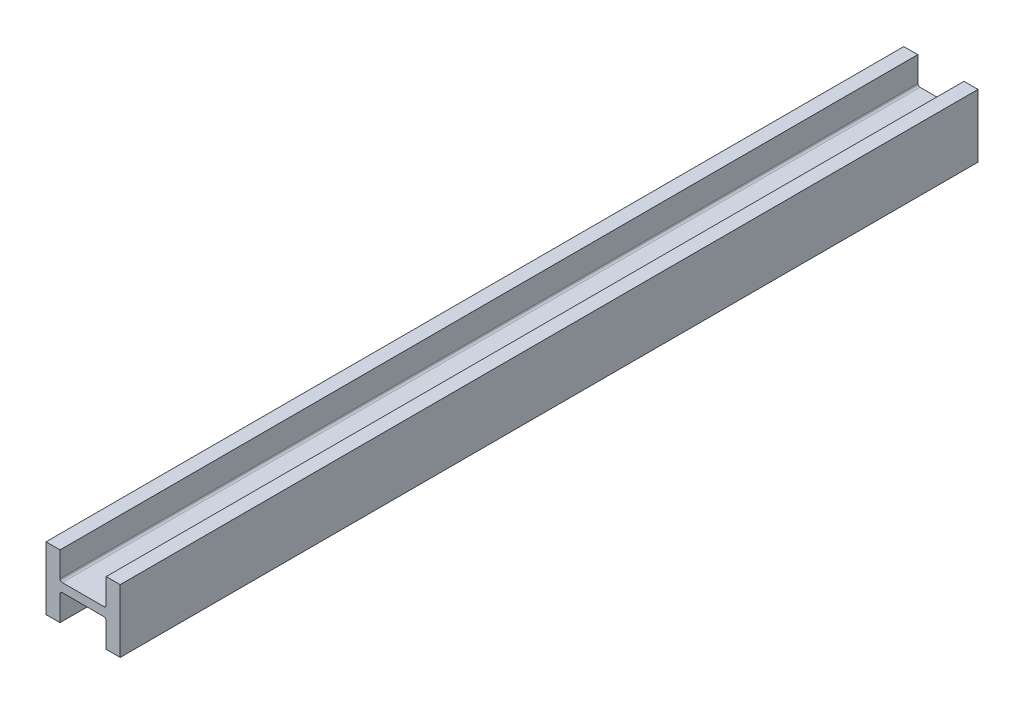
ISO-10303-21;
HEADER;
FILE_DESCRIPTION(('STEP AP214'),'2;1');
FILE_NAME('part.step','',(''),(''),'','','');
FILE_SCHEMA(('AUTOMOTIVE_DESIGN { 1 0 10303 214 1 1 1 1 }'));
ENDSEC;
DATA;
#1=APPLICATION_CONTEXT('core data for automotive mechanical design processes');
#2=APPLICATION_PROTOCOL_DEFINITION('international standard','automotive_design',2000,#1);
#3=PRODUCT_CONTEXT('',#1,'mechanical');
#4=PRODUCT('Part','Part','',(#3));
#5=PRODUCT_RELATED_PRODUCT_CATEGORY('part','',(#4));
#6=PRODUCT_DEFINITION_FORMATION('','',#4);
#7=PRODUCT_DEFINITION_CONTEXT('part definition',#1,'design');
#8=PRODUCT_DEFINITION('design','',#6,#7);
#9=PRODUCT_DEFINITION_SHAPE('','',#8);
#10=(LENGTH_UNIT() NAMED_UNIT(*) SI_UNIT(.MILLI.,.METRE.));
#11=(NAMED_UNIT(*) PLANE_ANGLE_UNIT() SI_UNIT($,.RADIAN.));
#12=(NAMED_UNIT(*) SI_UNIT($,.STERADIAN.) SOLID_ANGLE_UNIT());
#13=UNCERTAINTY_MEASURE_WITH_UNIT(LENGTH_MEASURE(1.E-05),#10,'distance_accuracy_value','');
#14=(GEOMETRIC_REPRESENTATION_CONTEXT(3) GLOBAL_UNCERTAINTY_ASSIGNED_CONTEXT((#13)) GLOBAL_UNIT_ASSIGNED_CONTEXT((#10,
#11,#12)) REPRESENTATION_CONTEXT('',''));
#15=CARTESIAN_POINT('',(0.,0.,0.));
#16=DIRECTION('',(0.,0.,1.));
#17=DIRECTION('',(1.,0.,0.));
#18=AXIS2_PLACEMENT_3D('',#15,#16,#17);
#19=CARTESIAN_POINT('',(257.048,218.440000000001,2971.8));
#20=DIRECTION('',(-1.,0.,0.));
#21=DIRECTION('',(0.,0.,1.));
#22=AXIS2_PLACEMENT_3D('',#19,#20,#21);
#23=PLANE('',#22);
#24=DIRECTION('',(0.,1.,0.));
#25=VECTOR('',#24,1.);
#26=CARTESIAN_POINT('',(257.048,218.440000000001,-2971.8));
#27=LINE('',#26,#25);
#28=CARTESIAN_POINT('',(257.048,-218.439999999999,-2971.8));
#29=VERTEX_POINT('',#28);
#30=CARTESIAN_POINT('',(257.048,218.440000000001,-2971.8));
#31=VERTEX_POINT('',#30);
#32=EDGE_CURVE('E193',#29,#31,#27,.T.);
#33=ORIENTED_EDGE('',*,*,#32,.T.);
#34=DIRECTION('',(0.,0.,-1.));
#35=VECTOR('',#34,1.);
#36=CARTESIAN_POINT('',(257.048,218.440000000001,2971.8));
#37=LINE('',#36,#35);
#38=CARTESIAN_POINT('',(257.048,218.440000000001,2971.8));
#39=VERTEX_POINT('',#38);
#40=EDGE_CURVE('E11',#39,#31,#37,.T.);
#41=ORIENTED_EDGE('',*,*,#40,.F.);
#42=DIRECTION('',(0.,1.,0.));
#43=VECTOR('',#42,1.);
#44=CARTESIAN_POINT('',(257.048,218.440000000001,2971.8));
#45=LINE('',#44,#43);
#46=CARTESIAN_POINT('',(257.048,-218.439999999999,2971.8));
#47=VERTEX_POINT('',#46);
#48=EDGE_CURVE('E238',#47,#39,#45,.T.);
#49=ORIENTED_EDGE('',*,*,#48,.F.);
#50=DIRECTION('',(0.,0.,-1.));
#51=VECTOR('',#50,1.);
#52=CARTESIAN_POINT('',(257.048,-218.439999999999,2971.8));
#53=LINE('',#52,#51);
#54=EDGE_CURVE('E186',#47,#29,#53,.T.);
#55=ORIENTED_EDGE('',*,*,#54,.T.);
#56=EDGE_LOOP('',(#33,#41,#49,#55));
#57=FACE_BOUND('',#56,.T.);
#58=ADVANCED_FACE('F44',(#57),#23,.F.);
#59=CARTESIAN_POINT('',(160.02,218.440000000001,2971.8));
#60=DIRECTION('',(0.,-1.,0.));
#61=DIRECTION('',(0.,0.,-1.));
#62=AXIS2_PLACEMENT_3D('',#59,#60,#61);
#63=PLANE('',#62);
#64=DIRECTION('',(-1.,0.,0.));
#65=VECTOR('',#64,1.);
#66=CARTESIAN_POINT('',(160.02,218.440000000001,-2971.8));
#67=LINE('',#66,#65);
#68=CARTESIAN_POINT('',(160.02,218.440000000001,-2971.8));
#69=VERTEX_POINT('',#68);
#70=EDGE_CURVE('E196',#31,#69,#67,.T.);
#71=ORIENTED_EDGE('',*,*,#70,.T.);
#72=DIRECTION('',(0.,0.,-1.));
#73=VECTOR('',#72,1.);
#74=CARTESIAN_POINT('',(160.02,218.440000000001,2971.8));
#75=LINE('',#74,#73);
#76=CARTESIAN_POINT('',(160.02,218.440000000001,2971.8));
#77=VERTEX_POINT('',#76);
#78=EDGE_CURVE('E53',#77,#69,#75,.T.);
#79=ORIENTED_EDGE('',*,*,#78,.F.);
#80=DIRECTION('',(-1.,0.,0.));
#81=VECTOR('',#80,1.);
#82=CARTESIAN_POINT('',(160.02,218.440000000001,2971.8));
#83=LINE('',#82,#81);
#84=EDGE_CURVE('E129',#39,#77,#83,.T.);
#85=ORIENTED_EDGE('',*,*,#84,.F.);
#86=ORIENTED_EDGE('',*,*,#40,.T.);
#87=EDGE_LOOP('',(#71,#79,#85,#86));
#88=FACE_BOUND('',#87,.T.);
#89=ADVANCED_FACE('F362',(#88),#63,.F.);
#90=CARTESIAN_POINT('',(160.02,45.4660000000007,2971.8));
#91=DIRECTION('',(1.,0.,0.));
#92=DIRECTION('',(0.,0.,-1.));
#93=AXIS2_PLACEMENT_3D('',#90,#91,#92);
#94=PLANE('',#93);
#95=DIRECTION('',(0.,-1.,0.));
#96=VECTOR('',#95,1.);
#97=CARTESIAN_POINT('',(160.02,45.4660000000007,-2971.8));
#98=LINE('',#97,#96);
#99=CARTESIAN_POINT('',(160.02,45.4660000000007,-2971.8));
#100=VERTEX_POINT('',#99);
#101=EDGE_CURVE('E203',#69,#100,#98,.T.);
#102=ORIENTED_EDGE('',*,*,#101,.T.);
#103=DIRECTION('',(0.,0.,-1.));
#104=VECTOR('',#103,1.);
#105=CARTESIAN_POINT('',(160.02,45.4660000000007,2971.8));
#106=LINE('',#105,#104);
#107=CARTESIAN_POINT('',(160.02,45.4660000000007,2971.8));
#108=VERTEX_POINT('',#107);
#109=EDGE_CURVE('E282',#108,#100,#106,.T.);
#110=ORIENTED_EDGE('',*,*,#109,.F.);
#111=DIRECTION('',(0.,-1.,0.));
#112=VECTOR('',#111,1.);
#113=CARTESIAN_POINT('',(160.02,45.4660000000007,2971.8));
#114=LINE('',#113,#112);
#115=EDGE_CURVE('E291',#77,#108,#114,.T.);
#116=ORIENTED_EDGE('',*,*,#115,.F.);
#117=ORIENTED_EDGE('',*,*,#78,.T.);
#118=EDGE_LOOP('',(#102,#110,#116,#117));
#119=FACE_BOUND('',#118,.T.);
#120=ADVANCED_FACE('F292',(#119),#94,.F.);
#121=CARTESIAN_POINT('',(144.78,45.4660000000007,2971.8));
#122=DIRECTION('',(0.,0.,-1.));
#123=DIRECTION('',(-1.,0.,0.));
#124=AXIS2_PLACEMENT_3D('',#121,#122,#123);
#125=CYLINDRICAL_SURFACE('',#124,15.24);
#126=CARTESIAN_POINT('',(144.78,45.4660000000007,-2971.8));
#127=DIRECTION('',(0.,0.,-1.));
#128=DIRECTION('',(1.,0.,0.));
#129=AXIS2_PLACEMENT_3D('',#126,#127,#128);
#130=CIRCLE('',#129,15.24);
#131=CARTESIAN_POINT('',(144.78,30.2260000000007,-2971.8));
#132=VERTEX_POINT('',#131);
#133=EDGE_CURVE('E204',#100,#132,#130,.T.);
#134=ORIENTED_EDGE('',*,*,#133,.T.);
#135=DIRECTION('',(0.,0.,-1.));
#136=VECTOR('',#135,1.);
#137=CARTESIAN_POINT('',(144.78,30.2260000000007,2971.8));
#138=LINE('',#137,#136);
#139=CARTESIAN_POINT('',(144.78,30.2260000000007,2971.8));
#140=VERTEX_POINT('',#139);
#141=EDGE_CURVE('E276',#140,#132,#138,.T.);
#142=ORIENTED_EDGE('',*,*,#141,.F.);
#143=CARTESIAN_POINT('',(144.78,45.4660000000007,2971.8));
#144=DIRECTION('',(0.,0.,-1.));
#145=DIRECTION('',(1.,0.,0.));
#146=AXIS2_PLACEMENT_3D('',#143,#144,#145);
#147=CIRCLE('',#146,15.24);
#148=EDGE_CURVE('E315',#108,#140,#147,.T.);
#149=ORIENTED_EDGE('',*,*,#148,.F.);
#150=ORIENTED_EDGE('',*,*,#109,.T.);
#151=EDGE_LOOP('',(#134,#142,#149,#150));
#152=FACE_BOUND('',#151,.T.);
#153=ADVANCED_FACE('F301',(#152),#125,.F.);
#154=CARTESIAN_POINT('',(-144.78,30.2260000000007,2971.8));
#155=DIRECTION('',(0.,-1.,0.));
#156=DIRECTION('',(1.,0.,0.));
#157=AXIS2_PLACEMENT_3D('',#154,#155,#156);
#158=PLANE('',#157);
#159=DIRECTION('',(-1.,0.,0.));
#160=VECTOR('',#159,1.);
#161=CARTESIAN_POINT('',(-144.78,30.2260000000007,-2971.8));
#162=LINE('',#161,#160);
#163=CARTESIAN_POINT('',(-144.78,30.2260000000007,-2971.8));
#164=VERTEX_POINT('',#163);
#165=EDGE_CURVE('E210',#132,#164,#162,.T.);
#166=ORIENTED_EDGE('',*,*,#165,.T.);
#167=DIRECTION('',(0.,0.,-1.));
#168=VECTOR('',#167,1.);
#169=CARTESIAN_POINT('',(-144.78,30.2260000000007,2971.8));
#170=LINE('',#169,#168);
#171=CARTESIAN_POINT('',(-144.78,30.2260000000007,2971.8));
#172=VERTEX_POINT('',#171);
#173=EDGE_CURVE('E274',#172,#164,#170,.T.);
#174=ORIENTED_EDGE('',*,*,#173,.F.);
#175=DIRECTION('',(-1.,0.,0.));
#176=VECTOR('',#175,1.);
#177=CARTESIAN_POINT('',(-144.78,30.2260000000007,2971.8));
#178=LINE('',#177,#176);
#179=EDGE_CURVE('E306',#140,#172,#178,.T.);
#180=ORIENTED_EDGE('',*,*,#179,.F.);
#181=ORIENTED_EDGE('',*,*,#141,.T.);
#182=EDGE_LOOP('',(#166,#174,#180,#181));
#183=FACE_BOUND('',#182,.T.);
#184=ADVANCED_FACE('F308',(#183),#158,.F.);
#185=CARTESIAN_POINT('',(-144.78,45.4660000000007,2971.8));
#186=DIRECTION('',(0.,0.,-1.));
#187=DIRECTION('',(-1.,0.,0.));
#188=AXIS2_PLACEMENT_3D('',#185,#186,#187);
#189=CYLINDRICAL_SURFACE('',#188,15.24);
#190=CARTESIAN_POINT('',(-144.78,45.4660000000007,-2971.8));
#191=DIRECTION('',(0.,0.,-1.));
#192=DIRECTION('',(1.,0.,0.));
#193=AXIS2_PLACEMENT_3D('',#190,#191,#192);
#194=CIRCLE('',#193,15.24);
#195=CARTESIAN_POINT('',(-160.02,45.4660000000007,-2971.8));
#196=VERTEX_POINT('',#195);
#197=EDGE_CURVE('E209',#164,#196,#194,.T.);
#198=ORIENTED_EDGE('',*,*,#197,.T.);
#199=DIRECTION('',(0.,0.,-1.));
#200=VECTOR('',#199,1.);
#201=CARTESIAN_POINT('',(-160.02,45.4660000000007,2971.8));
#202=LINE('',#201,#200);
#203=CARTESIAN_POINT('',(-160.02,45.4660000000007,2971.8));
#204=VERTEX_POINT('',#203);
#205=EDGE_CURVE('E271',#204,#196,#202,.T.);
#206=ORIENTED_EDGE('',*,*,#205,.F.);
#207=CARTESIAN_POINT('',(-144.78,45.4660000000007,2971.8));
#208=DIRECTION('',(0.,0.,-1.));
#209=DIRECTION('',(1.,0.,0.));
#210=AXIS2_PLACEMENT_3D('',#207,#208,#209);
#211=CIRCLE('',#210,15.24);
#212=EDGE_CURVE('E313',#172,#204,#211,.T.);
#213=ORIENTED_EDGE('',*,*,#212,.F.);
#214=ORIENTED_EDGE('',*,*,#173,.T.);
#215=EDGE_LOOP('',(#198,#206,#213,#214));
#216=FACE_BOUND('',#215,.T.);
#217=ADVANCED_FACE('F374',(#216),#189,.F.);
#218=CARTESIAN_POINT('',(-160.02,218.440000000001,2971.8));
#219=DIRECTION('',(-1.,0.,0.));
#220=DIRECTION('',(0.,0.,1.));
#221=AXIS2_PLACEMENT_3D('',#218,#219,#220);
#222=PLANE('',#221);
#223=DIRECTION('',(0.,1.,0.));
#224=VECTOR('',#223,1.);
#225=CARTESIAN_POINT('',(-160.02,218.440000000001,-2971.8));
#226=LINE('',#225,#224);
#227=CARTESIAN_POINT('',(-160.02,218.440000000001,-2971.8));
#228=VERTEX_POINT('',#227);
#229=EDGE_CURVE('E213',#196,#228,#226,.T.);
#230=ORIENTED_EDGE('',*,*,#229,.T.);
#231=DIRECTION('',(0.,0.,-1.));
#232=VECTOR('',#231,1.);
#233=CARTESIAN_POINT('',(-160.02,218.440000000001,2971.8));
#234=LINE('',#233,#232);
#235=CARTESIAN_POINT('',(-160.02,218.440000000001,2971.8));
#236=VERTEX_POINT('',#235);
#237=EDGE_CURVE('E270',#236,#228,#234,.T.);
#238=ORIENTED_EDGE('',*,*,#237,.F.);
#239=DIRECTION('',(0.,1.,0.));
#240=VECTOR('',#239,1.);
#241=CARTESIAN_POINT('',(-160.02,218.440000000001,2971.8));
#242=LINE('',#241,#240);
#243=EDGE_CURVE('E316',#204,#236,#242,.T.);
#244=ORIENTED_EDGE('',*,*,#243,.F.);
#245=ORIENTED_EDGE('',*,*,#205,.T.);
#246=EDGE_LOOP('',(#230,#238,#244,#245));
#247=FACE_BOUND('',#246,.T.);
#248=ADVANCED_FACE('F378',(#247),#222,.F.);
#249=CARTESIAN_POINT('',(-257.048,218.440000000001,2971.8));
#250=DIRECTION('',(0.,-1.,0.));
#251=DIRECTION('',(1.,0.,0.));
#252=AXIS2_PLACEMENT_3D('',#249,#250,#251);
#253=PLANE('',#252);
#254=DIRECTION('',(-1.,0.,0.));
#255=VECTOR('',#254,1.);
#256=CARTESIAN_POINT('',(-257.048,218.440000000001,-2971.8));
#257=LINE('',#256,#255);
#258=CARTESIAN_POINT('',(-257.048,218.440000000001,-2971.8));
#259=VERTEX_POINT('',#258);
#260=EDGE_CURVE('E216',#228,#259,#257,.T.);
#261=ORIENTED_EDGE('',*,*,#260,.T.);
#262=DIRECTION('',(0.,0.,-1.));
#263=VECTOR('',#262,1.);
#264=CARTESIAN_POINT('',(-257.048,218.440000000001,2971.8));
#265=LINE('',#264,#263);
#266=CARTESIAN_POINT('',(-257.048,218.440000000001,2971.8));
#267=VERTEX_POINT('',#266);
#268=EDGE_CURVE('E263',#267,#259,#265,.T.);
#269=ORIENTED_EDGE('',*,*,#268,.F.);
#270=DIRECTION('',(-1.,0.,0.));
#271=VECTOR('',#270,1.);
#272=CARTESIAN_POINT('',(-257.048,218.440000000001,2971.8));
#273=LINE('',#272,#271);
#274=EDGE_CURVE('E323',#236,#267,#273,.T.);
#275=ORIENTED_EDGE('',*,*,#274,.F.);
#276=ORIENTED_EDGE('',*,*,#237,.T.);
#277=EDGE_LOOP('',(#261,#269,#275,#276));
#278=FACE_BOUND('',#277,.T.);
#279=ADVANCED_FACE('F385',(#278),#253,.F.);
#280=CARTESIAN_POINT('',(-257.048,-218.439999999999,2971.8));
#281=DIRECTION('',(1.,0.,0.));
#282=DIRECTION('',(0.,1.,0.));
#283=AXIS2_PLACEMENT_3D('',#280,#281,#282);
#284=PLANE('',#283);
#285=DIRECTION('',(0.,-1.,0.));
#286=VECTOR('',#285,1.);
#287=CARTESIAN_POINT('',(-257.048,-218.439999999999,-2971.8));
#288=LINE('',#287,#286);
#289=CARTESIAN_POINT('',(-257.048,-218.439999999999,-2971.8));
#290=VERTEX_POINT('',#289);
#291=EDGE_CURVE('E218',#259,#290,#288,.T.);
#292=ORIENTED_EDGE('',*,*,#291,.T.);
#293=DIRECTION('',(0.,0.,-1.));
#294=VECTOR('',#293,1.);
#295=CARTESIAN_POINT('',(-257.048,-218.439999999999,2971.8));
#296=LINE('',#295,#294);
#297=CARTESIAN_POINT('',(-257.048,-218.439999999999,2971.8));
#298=VERTEX_POINT('',#297);
#299=EDGE_CURVE('E259',#298,#290,#296,.T.);
#300=ORIENTED_EDGE('',*,*,#299,.F.);
#301=DIRECTION('',(0.,-1.,0.));
#302=VECTOR('',#301,1.);
#303=CARTESIAN_POINT('',(-257.048,-218.439999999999,2971.8));
#304=LINE('',#303,#302);
#305=EDGE_CURVE('E326',#267,#298,#304,.T.);
#306=ORIENTED_EDGE('',*,*,#305,.F.);
#307=ORIENTED_EDGE('',*,*,#268,.T.);
#308=EDGE_LOOP('',(#292,#300,#306,#307));
#309=FACE_BOUND('',#308,.T.);
#310=ADVANCED_FACE('F387',(#309),#284,.F.);
#311=CARTESIAN_POINT('',(-160.02,-218.439999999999,2971.8));
#312=DIRECTION('',(0.,1.,0.));
#313=DIRECTION('',(0.,0.,1.));
#314=AXIS2_PLACEMENT_3D('',#311,#312,#313);
#315=PLANE('',#314);
#316=DIRECTION('',(1.,0.,0.));
#317=VECTOR('',#316,1.);
#318=CARTESIAN_POINT('',(-160.02,-218.439999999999,-2971.8));
#319=LINE('',#318,#317);
#320=CARTESIAN_POINT('',(-160.02,-218.439999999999,-2971.8));
#321=VERTEX_POINT('',#320);
#322=EDGE_CURVE('E225',#290,#321,#319,.T.);
#323=ORIENTED_EDGE('',*,*,#322,.T.);
#324=DIRECTION('',(0.,0.,-1.));
#325=VECTOR('',#324,1.);
#326=CARTESIAN_POINT('',(-160.02,-218.439999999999,2971.8));
#327=LINE('',#326,#325);
#328=CARTESIAN_POINT('',(-160.02,-218.439999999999,2971.8));
#329=VERTEX_POINT('',#328);
#330=EDGE_CURVE('E254',#329,#321,#327,.T.);
#331=ORIENTED_EDGE('',*,*,#330,.F.);
#332=DIRECTION('',(1.,0.,0.));
#333=VECTOR('',#332,1.);
#334=CARTESIAN_POINT('',(-160.02,-218.439999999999,2971.8));
#335=LINE('',#334,#333);
#336=EDGE_CURVE('E328',#298,#329,#335,.T.);
#337=ORIENTED_EDGE('',*,*,#336,.F.);
#338=ORIENTED_EDGE('',*,*,#299,.T.);
#339=EDGE_LOOP('',(#323,#331,#337,#338));
#340=FACE_BOUND('',#339,.T.);
#341=ADVANCED_FACE('F388',(#340),#315,.F.);
#342=CARTESIAN_POINT('',(-160.02,-45.4659999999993,2971.8));
#343=DIRECTION('',(-1.,0.,0.));
#344=DIRECTION('',(0.,-1.,0.));
#345=AXIS2_PLACEMENT_3D('',#342,#343,#344);
#346=PLANE('',#345);
#347=DIRECTION('',(0.,1.,0.));
#348=VECTOR('',#347,1.);
#349=CARTESIAN_POINT('',(-160.02,-45.4659999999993,-2971.8));
#350=LINE('',#349,#348);
#351=CARTESIAN_POINT('',(-160.02,-45.4659999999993,-2971.8));
#352=VERTEX_POINT('',#351);
#353=EDGE_CURVE('E223',#321,#352,#350,.T.);
#354=ORIENTED_EDGE('',*,*,#353,.T.);
#355=DIRECTION('',(0.,0.,-1.));
#356=VECTOR('',#355,1.);
#357=CARTESIAN_POINT('',(-160.02,-45.4659999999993,2971.8));
#358=LINE('',#357,#356);
#359=CARTESIAN_POINT('',(-160.02,-45.4659999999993,2971.8));
#360=VERTEX_POINT('',#359);
#361=EDGE_CURVE('E253',#360,#352,#358,.T.);
#362=ORIENTED_EDGE('',*,*,#361,.F.);
#363=DIRECTION('',(0.,1.,0.));
#364=VECTOR('',#363,1.);
#365=CARTESIAN_POINT('',(-160.02,-45.4659999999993,2971.8));
#366=LINE('',#365,#364);
#367=EDGE_CURVE('E335',#329,#360,#366,.T.);
#368=ORIENTED_EDGE('',*,*,#367,.F.);
#369=ORIENTED_EDGE('',*,*,#330,.T.);
#370=EDGE_LOOP('',(#354,#362,#368,#369));
#371=FACE_BOUND('',#370,.T.);
#372=ADVANCED_FACE('F395',(#371),#346,.F.);
#373=CARTESIAN_POINT('',(-144.78,-45.4659999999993,2971.8));
#374=DIRECTION('',(0.,0.,-1.));
#375=DIRECTION('',(-1.,0.,0.));
#376=AXIS2_PLACEMENT_3D('',#373,#374,#375);
#377=CYLINDRICAL_SURFACE('',#376,15.24);
#378=CARTESIAN_POINT('',(-144.78,-45.4659999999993,-2971.8));
#379=DIRECTION('',(0.,0.,-1.));
#380=DIRECTION('',(1.,0.,0.));
#381=AXIS2_PLACEMENT_3D('',#378,#379,#380);
#382=CIRCLE('',#381,15.24);
#383=CARTESIAN_POINT('',(-144.78,-30.2259999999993,-2971.8));
#384=VERTEX_POINT('',#383);
#385=EDGE_CURVE('E227',#352,#384,#382,.T.);
#386=ORIENTED_EDGE('',*,*,#385,.T.);
#387=DIRECTION('',(0.,0.,-1.));
#388=VECTOR('',#387,1.);
#389=CARTESIAN_POINT('',(-144.78,-30.2259999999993,2971.8));
#390=LINE('',#389,#388);
#391=CARTESIAN_POINT('',(-144.78,-30.2259999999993,2971.8));
#392=VERTEX_POINT('',#391);
#393=EDGE_CURVE('E246',#392,#384,#390,.T.);
#394=ORIENTED_EDGE('',*,*,#393,.F.);
#395=CARTESIAN_POINT('',(-144.78,-45.4659999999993,2971.8));
#396=DIRECTION('',(0.,0.,-1.));
#397=DIRECTION('',(1.,0.,0.));
#398=AXIS2_PLACEMENT_3D('',#395,#396,#397);
#399=CIRCLE('',#398,15.24);
#400=EDGE_CURVE('E333',#360,#392,#399,.T.);
#401=ORIENTED_EDGE('',*,*,#400,.F.);
#402=ORIENTED_EDGE('',*,*,#361,.T.);
#403=EDGE_LOOP('',(#386,#394,#401,#402));
#404=FACE_BOUND('',#403,.T.);
#405=ADVANCED_FACE('F345',(#404),#377,.F.);
#406=CARTESIAN_POINT('',(144.78,-30.2259999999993,2971.8));
#407=DIRECTION('',(0.,1.,0.));
#408=DIRECTION('',(-1.,0.,0.));
#409=AXIS2_PLACEMENT_3D('',#406,#407,#408);
#410=PLANE('',#409);
#411=DIRECTION('',(1.,0.,0.));
#412=VECTOR('',#411,1.);
#413=CARTESIAN_POINT('',(144.78,-30.2259999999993,-2971.8));
#414=LINE('',#413,#412);
#415=CARTESIAN_POINT('',(144.78,-30.2259999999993,-2971.8));
#416=VERTEX_POINT('',#415);
#417=EDGE_CURVE('E234',#384,#416,#414,.T.);
#418=ORIENTED_EDGE('',*,*,#417,.T.);
#419=DIRECTION('',(0.,0.,-1.));
#420=VECTOR('',#419,1.);
#421=CARTESIAN_POINT('',(144.78,-30.2259999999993,2971.8));
#422=LINE('',#421,#420);
#423=CARTESIAN_POINT('',(144.78,-30.2259999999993,2971.8));
#424=VERTEX_POINT('',#423);
#425=EDGE_CURVE('E181',#424,#416,#422,.T.);
#426=ORIENTED_EDGE('',*,*,#425,.F.);
#427=DIRECTION('',(1.,0.,0.));
#428=VECTOR('',#427,1.);
#429=CARTESIAN_POINT('',(144.78,-30.2259999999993,2971.8));
#430=LINE('',#429,#428);
#431=EDGE_CURVE('E174',#392,#424,#430,.T.);
#432=ORIENTED_EDGE('',*,*,#431,.F.);
#433=ORIENTED_EDGE('',*,*,#393,.T.);
#434=EDGE_LOOP('',(#418,#426,#432,#433));
#435=FACE_BOUND('',#434,.T.);
#436=ADVANCED_FACE('F350',(#435),#410,.F.);
#437=CARTESIAN_POINT('',(144.78,-45.4659999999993,2971.8));
#438=DIRECTION('',(0.,0.,-1.));
#439=DIRECTION('',(-1.,0.,0.));
#440=AXIS2_PLACEMENT_3D('',#437,#438,#439);
#441=CYLINDRICAL_SURFACE('',#440,15.24);
#442=CARTESIAN_POINT('',(144.78,-45.4659999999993,-2971.8));
#443=DIRECTION('',(0.,0.,-1.));
#444=DIRECTION('',(1.,0.,0.));
#445=AXIS2_PLACEMENT_3D('',#442,#443,#444);
#446=CIRCLE('',#445,15.24);
#447=CARTESIAN_POINT('',(160.02,-45.4659999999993,-2971.8));
#448=VERTEX_POINT('',#447);
#449=EDGE_CURVE('E182',#416,#448,#446,.T.);
#450=ORIENTED_EDGE('',*,*,#449,.T.);
#451=DIRECTION('',(0.,0.,-1.));
#452=VECTOR('',#451,1.);
#453=CARTESIAN_POINT('',(160.02,-45.4659999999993,2971.8));
#454=LINE('',#453,#452);
#455=CARTESIAN_POINT('',(160.02,-45.4659999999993,2971.8));
#456=VERTEX_POINT('',#455);
#457=EDGE_CURVE('E180',#456,#448,#454,.T.);
#458=ORIENTED_EDGE('',*,*,#457,.F.);
#459=CARTESIAN_POINT('',(144.78,-45.4659999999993,2971.8));
#460=DIRECTION('',(0.,0.,-1.));
#461=DIRECTION('',(1.,0.,0.));
#462=AXIS2_PLACEMENT_3D('',#459,#460,#461);
#463=CIRCLE('',#462,15.24);
#464=EDGE_CURVE('E167',#424,#456,#463,.T.);
#465=ORIENTED_EDGE('',*,*,#464,.F.);
#466=ORIENTED_EDGE('',*,*,#425,.T.);
#467=EDGE_LOOP('',(#450,#458,#465,#466));
#468=FACE_BOUND('',#467,.T.);
#469=ADVANCED_FACE('F178',(#468),#441,.F.);
#470=CARTESIAN_POINT('',(160.02,-218.439999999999,2971.8));
#471=DIRECTION('',(1.,0.,0.));
#472=DIRECTION('',(0.,0.,-1.));
#473=AXIS2_PLACEMENT_3D('',#470,#471,#472);
#474=PLANE('',#473);
#475=DIRECTION('',(0.,-1.,0.));
#476=VECTOR('',#475,1.);
#477=CARTESIAN_POINT('',(160.02,-218.439999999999,-2971.8));
#478=LINE('',#477,#476);
#479=CARTESIAN_POINT('',(160.02,-218.439999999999,-2971.8));
#480=VERTEX_POINT('',#479);
#481=EDGE_CURVE('E113',#448,#480,#478,.T.);
#482=ORIENTED_EDGE('',*,*,#481,.T.);
#483=DIRECTION('',(0.,0.,-1.));
#484=VECTOR('',#483,1.);
#485=CARTESIAN_POINT('',(160.02,-218.439999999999,2971.8));
#486=LINE('',#485,#484);
#487=CARTESIAN_POINT('',(160.02,-218.439999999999,2971.8));
#488=VERTEX_POINT('',#487);
#489=EDGE_CURVE('E184',#488,#480,#486,.T.);
#490=ORIENTED_EDGE('',*,*,#489,.F.);
#491=DIRECTION('',(0.,-1.,0.));
#492=VECTOR('',#491,1.);
#493=CARTESIAN_POINT('',(160.02,-218.439999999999,2971.8));
#494=LINE('',#493,#492);
#495=EDGE_CURVE('E168',#456,#488,#494,.T.);
#496=ORIENTED_EDGE('',*,*,#495,.F.);
#497=ORIENTED_EDGE('',*,*,#457,.T.);
#498=EDGE_LOOP('',(#482,#490,#496,#497));
#499=FACE_BOUND('',#498,.T.);
#500=ADVANCED_FACE('F188',(#499),#474,.F.);
#501=CARTESIAN_POINT('',(257.048,-218.439999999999,2971.8));
#502=DIRECTION('',(0.,1.,0.));
#503=DIRECTION('',(0.,0.,1.));
#504=AXIS2_PLACEMENT_3D('',#501,#502,#503);
#505=PLANE('',#504);
#506=DIRECTION('',(1.,0.,0.));
#507=VECTOR('',#506,1.);
#508=CARTESIAN_POINT('',(257.048,-218.439999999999,-2971.8));
#509=LINE('',#508,#507);
#510=EDGE_CURVE('E124',#480,#29,#509,.T.);
#511=ORIENTED_EDGE('',*,*,#510,.T.);
#512=ORIENTED_EDGE('',*,*,#54,.F.);
#513=DIRECTION('',(1.,0.,0.));
#514=VECTOR('',#513,1.);
#515=CARTESIAN_POINT('',(257.048,-218.439999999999,2971.8));
#516=LINE('',#515,#514);
#517=EDGE_CURVE('E64',#488,#47,#516,.T.);
#518=ORIENTED_EDGE('',*,*,#517,.F.);
#519=ORIENTED_EDGE('',*,*,#489,.T.);
#520=EDGE_LOOP('',(#511,#512,#518,#519));
#521=FACE_BOUND('',#520,.T.);
#522=ADVANCED_FACE('F353',(#521),#505,.F.);
#523=CARTESIAN_POINT('',(144.78,-45.4659999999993,2971.8));
#524=DIRECTION('',(0.,0.,1.));
#525=DIRECTION('',(1.,0.,0.));
#526=AXIS2_PLACEMENT_3D('',#523,#524,#525);
#527=PLANE('',#526);
#528=ORIENTED_EDGE('',*,*,#48,.T.);
#529=ORIENTED_EDGE('',*,*,#84,.T.);
#530=ORIENTED_EDGE('',*,*,#115,.T.);
#531=ORIENTED_EDGE('',*,*,#148,.T.);
#532=ORIENTED_EDGE('',*,*,#179,.T.);
#533=ORIENTED_EDGE('',*,*,#212,.T.);
#534=ORIENTED_EDGE('',*,*,#243,.T.);
#535=ORIENTED_EDGE('',*,*,#274,.T.);
#536=ORIENTED_EDGE('',*,*,#305,.T.);
#537=ORIENTED_EDGE('',*,*,#336,.T.);
#538=ORIENTED_EDGE('',*,*,#367,.T.);
#539=ORIENTED_EDGE('',*,*,#400,.T.);
#540=ORIENTED_EDGE('',*,*,#431,.T.);
#541=ORIENTED_EDGE('',*,*,#464,.T.);
#542=ORIENTED_EDGE('',*,*,#495,.T.);
#543=ORIENTED_EDGE('',*,*,#517,.T.);
#544=EDGE_LOOP('',(#528,#529,#530,#531,#532,#533,#534,#535,#536,#537,#538,#539,#540,#541,#542,#543));
#545=FACE_BOUND('',#544,.T.);
#546=ADVANCED_FACE('F169',(#545),#527,.T.);
#547=CARTESIAN_POINT('',(144.78,-45.4659999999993,-2971.8));
#548=DIRECTION('',(0.,0.,1.));
#549=DIRECTION('',(1.,0.,0.));
#550=AXIS2_PLACEMENT_3D('',#547,#548,#549);
#551=PLANE('',#550);
#552=ORIENTED_EDGE('',*,*,#32,.F.);
#553=ORIENTED_EDGE('',*,*,#510,.F.);
#554=ORIENTED_EDGE('',*,*,#481,.F.);
#555=ORIENTED_EDGE('',*,*,#449,.F.);
#556=ORIENTED_EDGE('',*,*,#417,.F.);
#557=ORIENTED_EDGE('',*,*,#385,.F.);
#558=ORIENTED_EDGE('',*,*,#353,.F.);
#559=ORIENTED_EDGE('',*,*,#322,.F.);
#560=ORIENTED_EDGE('',*,*,#291,.F.);
#561=ORIENTED_EDGE('',*,*,#260,.F.);
#562=ORIENTED_EDGE('',*,*,#229,.F.);
#563=ORIENTED_EDGE('',*,*,#197,.F.);
#564=ORIENTED_EDGE('',*,*,#165,.F.);
#565=ORIENTED_EDGE('',*,*,#133,.F.);
#566=ORIENTED_EDGE('',*,*,#101,.F.);
#567=ORIENTED_EDGE('',*,*,#70,.F.);
#568=EDGE_LOOP('',(#552,#553,#554,#555,#556,#557,#558,#559,#560,#561,#562,#563,#564,#565,#566,#567));
#569=FACE_BOUND('',#568,.T.);
#570=ADVANCED_FACE('F299',(#569),#551,.F.);
#571=CLOSED_SHELL('',(#58,#89,#120,#153,#184,#217,#248,#279,#310,#341,#372,#405,#436,#469,#500,
#522,#546,#570));
#572=MANIFOLD_SOLID_BREP('B2',#571);
#573=ADVANCED_BREP_SHAPE_REPRESENTATION('',(#18,#572),#14);
#574=SHAPE_DEFINITION_REPRESENTATION(#9,#573);
ENDSEC;
END-ISO-10303-21;
